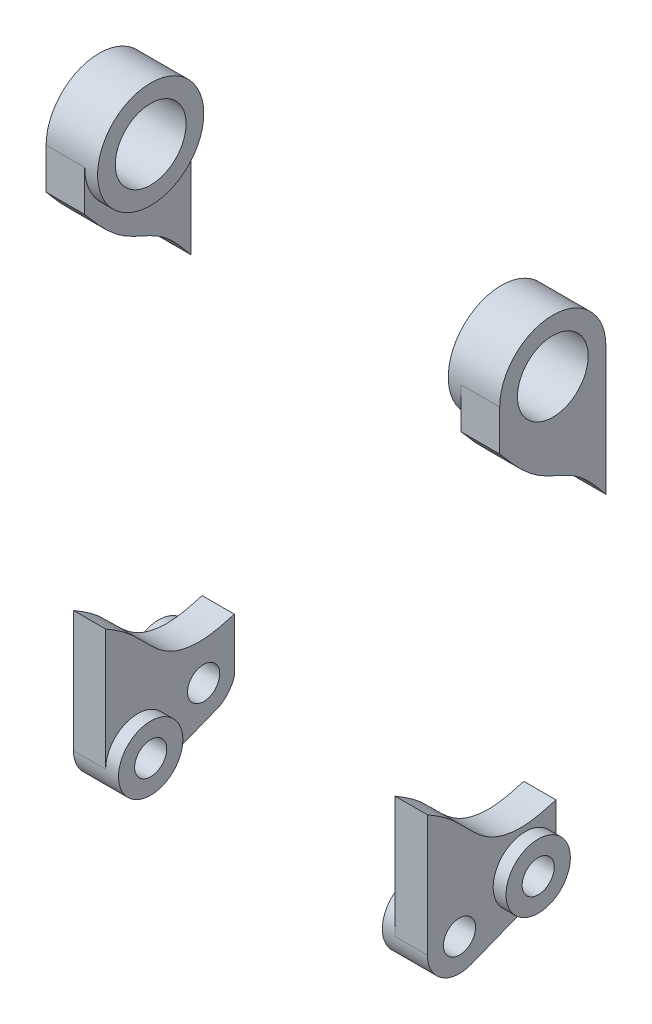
ISO-10303-21;
HEADER;
FILE_DESCRIPTION(('STEP AP214'),'2;1');
FILE_NAME('part.step','',(''),(''),'','','');
FILE_SCHEMA(('AUTOMOTIVE_DESIGN { 1 0 10303 214 1 1 1 1 }'));
ENDSEC;
DATA;
#1=APPLICATION_CONTEXT('core data for automotive mechanical design processes');
#2=APPLICATION_PROTOCOL_DEFINITION('international standard','automotive_design',2000,#1);
#3=PRODUCT_CONTEXT('',#1,'mechanical');
#4=PRODUCT('Part','Part','',(#3));
#5=PRODUCT_RELATED_PRODUCT_CATEGORY('part','',(#4));
#6=PRODUCT_DEFINITION_FORMATION('','',#4);
#7=PRODUCT_DEFINITION_CONTEXT('part definition',#1,'design');
#8=PRODUCT_DEFINITION('design','',#6,#7);
#9=PRODUCT_DEFINITION_SHAPE('','',#8);
#10=(LENGTH_UNIT() NAMED_UNIT(*) SI_UNIT(.MILLI.,.METRE.));
#11=(NAMED_UNIT(*) PLANE_ANGLE_UNIT() SI_UNIT($,.RADIAN.));
#12=(NAMED_UNIT(*) SI_UNIT($,.STERADIAN.) SOLID_ANGLE_UNIT());
#13=UNCERTAINTY_MEASURE_WITH_UNIT(LENGTH_MEASURE(1.E-05),#10,'distance_accuracy_value','');
#14=(GEOMETRIC_REPRESENTATION_CONTEXT(3) GLOBAL_UNCERTAINTY_ASSIGNED_CONTEXT((#13)) GLOBAL_UNIT_ASSIGNED_CONTEXT((#10,
#11,#12)) REPRESENTATION_CONTEXT('',''));
#15=CARTESIAN_POINT('',(0.,0.,0.));
#16=DIRECTION('',(0.,0.,1.));
#17=DIRECTION('',(1.,0.,0.));
#18=AXIS2_PLACEMENT_3D('',#15,#16,#17);
#19=CARTESIAN_POINT('',(54.5,90.,-3.5));
#20=DIRECTION('',(1.,0.,0.));
#21=DIRECTION('',(0.,0.,-1.));
#22=AXIS2_PLACEMENT_3D('',#19,#20,#21);
#23=PLANE('',#22);
#24=CARTESIAN_POINT('',(54.5,90.,-3.5));
#25=DIRECTION('',(1.,0.,0.));
#26=DIRECTION('',(0.,0.,-1.));
#27=AXIS2_PLACEMENT_3D('',#24,#25,#26);
#28=CIRCLE('',#27,11.);
#29=CARTESIAN_POINT('',(54.5,90.,-14.5));
#30=VERTEX_POINT('',#29);
#31=EDGE_CURVE('E112',#30,#30,#28,.T.);
#32=ORIENTED_EDGE('',*,*,#31,.T.);
#33=EDGE_LOOP('',(#32));
#34=FACE_BOUND('',#33,.T.);
#35=CARTESIAN_POINT('',(54.5,90.,-3.5));
#36=DIRECTION('',(1.,0.,0.));
#37=DIRECTION('',(0.,0.,-1.));
#38=AXIS2_PLACEMENT_3D('',#35,#36,#37);
#39=CIRCLE('',#38,16.5);
#40=CARTESIAN_POINT('',(54.5,90.,-20.));
#41=VERTEX_POINT('',#40);
#42=EDGE_CURVE('E111',#41,#41,#39,.T.);
#43=ORIENTED_EDGE('',*,*,#42,.F.);
#44=EDGE_LOOP('',(#43));
#45=FACE_BOUND('',#44,.T.);
#46=ADVANCED_FACE('F41',(#34,#45),#23,.F.);
#47=CARTESIAN_POINT('',(-70.5,90.,-3.5));
#48=DIRECTION('',(1.,0.,0.));
#49=DIRECTION('',(0.,0.,-1.));
#50=AXIS2_PLACEMENT_3D('',#47,#48,#49);
#51=CYLINDRICAL_SURFACE('',#50,11.);
#52=CARTESIAN_POINT('',(70.5,90.,-3.5));
#53=DIRECTION('',(1.,0.,0.));
#54=DIRECTION('',(0.,0.,-1.));
#55=AXIS2_PLACEMENT_3D('',#52,#53,#54);
#56=CIRCLE('',#55,11.);
#57=CARTESIAN_POINT('',(70.5,90.,-14.5));
#58=VERTEX_POINT('',#57);
#59=EDGE_CURVE('E117',#58,#58,#56,.T.);
#60=ORIENTED_EDGE('',*,*,#59,.T.);
#61=EDGE_LOOP('',(#60));
#62=FACE_BOUND('',#61,.T.);
#63=ORIENTED_EDGE('',*,*,#31,.F.);
#64=EDGE_LOOP('',(#63));
#65=FACE_BOUND('',#64,.T.);
#66=ADVANCED_FACE('F136',(#62,#65),#51,.F.);
#67=CARTESIAN_POINT('',(54.5,90.,-3.5));
#68=DIRECTION('',(1.,0.,0.));
#69=DIRECTION('',(0.,0.,-1.));
#70=AXIS2_PLACEMENT_3D('',#67,#68,#69);
#71=CYLINDRICAL_SURFACE('',#70,16.5);
#72=ORIENTED_EDGE('',*,*,#42,.T.);
#73=EDGE_LOOP('',(#72));
#74=FACE_BOUND('',#73,.T.);
#75=DIRECTION('',(-1.,0.,0.));
#76=VECTOR('',#75,1.);
#77=CARTESIAN_POINT('',(58.5,90.,-20.));
#78=LINE('',#77,#76);
#79=CARTESIAN_POINT('',(70.5,90.,-20.));
#80=VERTEX_POINT('',#79);
#81=CARTESIAN_POINT('',(58.5,90.,-20.));
#82=VERTEX_POINT('',#81);
#83=EDGE_CURVE('E97',#80,#82,#78,.T.);
#84=ORIENTED_EDGE('',*,*,#83,.T.);
#85=CARTESIAN_POINT('',(58.5,90.,-3.5));
#86=DIRECTION('',(1.,0.,0.));
#87=DIRECTION('',(0.,1.,0.));
#88=AXIS2_PLACEMENT_3D('',#85,#86,#87);
#89=CIRCLE('',#88,16.5);
#90=CARTESIAN_POINT('',(58.5,90.,13.));
#91=VERTEX_POINT('',#90);
#92=EDGE_CURVE('E63',#91,#82,#89,.T.);
#93=ORIENTED_EDGE('',*,*,#92,.F.);
#94=DIRECTION('',(1.,0.,0.));
#95=VECTOR('',#94,1.);
#96=CARTESIAN_POINT('',(0.,90.,13.));
#97=LINE('',#96,#95);
#98=CARTESIAN_POINT('',(70.5,90.,13.));
#99=VERTEX_POINT('',#98);
#100=EDGE_CURVE('E99',#91,#99,#97,.T.);
#101=ORIENTED_EDGE('',*,*,#100,.T.);
#102=CARTESIAN_POINT('',(70.5,90.,-3.5));
#103=DIRECTION('',(1.,0.,0.));
#104=DIRECTION('',(0.,0.,-1.));
#105=AXIS2_PLACEMENT_3D('',#102,#103,#104);
#106=CIRCLE('',#105,16.5);
#107=EDGE_CURVE('E109',#80,#99,#106,.T.);
#108=ORIENTED_EDGE('',*,*,#107,.F.);
#109=EDGE_LOOP('',(#84,#93,#101,#108));
#110=FACE_BOUND('',#109,.T.);
#111=ADVANCED_FACE('F108',(#74,#110),#71,.T.);
#112=CARTESIAN_POINT('',(0.,90.,13.));
#113=DIRECTION('',(0.,0.,-1.));
#114=DIRECTION('',(0.,1.,0.));
#115=AXIS2_PLACEMENT_3D('',#112,#113,#114);
#116=PLANE('',#115);
#117=DIRECTION('',(0.,1.,0.));
#118=VECTOR('',#117,1.);
#119=CARTESIAN_POINT('',(58.5,28.5000000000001,13.));
#120=LINE('',#119,#118);
#121=CARTESIAN_POINT('',(58.5,77.3406937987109,13.));
#122=VERTEX_POINT('',#121);
#123=EDGE_CURVE('E12',#122,#91,#120,.T.);
#124=ORIENTED_EDGE('',*,*,#123,.F.);
#125=DIRECTION('',(-1.,0.,0.));
#126=VECTOR('',#125,1.);
#127=CARTESIAN_POINT('',(70.5,77.3406937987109,13.));
#128=LINE('',#127,#126);
#129=CARTESIAN_POINT('',(70.5,77.3406937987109,13.));
#130=VERTEX_POINT('',#129);
#131=EDGE_CURVE('E86',#130,#122,#128,.T.);
#132=ORIENTED_EDGE('',*,*,#131,.F.);
#133=DIRECTION('',(0.,1.,0.));
#134=VECTOR('',#133,1.);
#135=CARTESIAN_POINT('',(70.5,90.,13.));
#136=LINE('',#135,#134);
#137=EDGE_CURVE('E93',#130,#99,#136,.T.);
#138=ORIENTED_EDGE('',*,*,#137,.T.);
#139=ORIENTED_EDGE('',*,*,#100,.F.);
#140=EDGE_LOOP('',(#124,#132,#138,#139));
#141=FACE_BOUND('',#140,.T.);
#142=ADVANCED_FACE('F122',(#141),#116,.F.);
#143=CARTESIAN_POINT('',(48.5,28.5000000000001,-20.));
#144=DIRECTION('',(0.,0.,1.));
#145=DIRECTION('',(1.,0.,0.));
#146=AXIS2_PLACEMENT_3D('',#143,#144,#145);
#147=PLANE('',#146);
#148=DIRECTION('',(0.,1.,0.));
#149=VECTOR('',#148,1.);
#150=CARTESIAN_POINT('',(70.5,90.,-20.));
#151=LINE('',#150,#149);
#152=CARTESIAN_POINT('',(70.5,50.,-20.));
#153=VERTEX_POINT('',#152);
#154=EDGE_CURVE('E91',#153,#80,#151,.T.);
#155=ORIENTED_EDGE('',*,*,#154,.F.);
#156=DIRECTION('',(-1.,0.,0.));
#157=VECTOR('',#156,1.);
#158=CARTESIAN_POINT('',(70.5,50.,-20.));
#159=LINE('',#158,#157);
#160=CARTESIAN_POINT('',(58.5,50.,-20.));
#161=VERTEX_POINT('',#160);
#162=EDGE_CURVE('E80',#153,#161,#159,.T.);
#163=ORIENTED_EDGE('',*,*,#162,.T.);
#164=DIRECTION('',(0.,-1.,0.));
#165=VECTOR('',#164,1.);
#166=CARTESIAN_POINT('',(58.5,28.5000000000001,-20.));
#167=LINE('',#166,#165);
#168=EDGE_CURVE('E49',#82,#161,#167,.T.);
#169=ORIENTED_EDGE('',*,*,#168,.F.);
#170=ORIENTED_EDGE('',*,*,#83,.F.);
#171=EDGE_LOOP('',(#155,#163,#169,#170));
#172=FACE_BOUND('',#171,.T.);
#173=ADVANCED_FACE('F95',(#172),#147,.F.);
#174=CARTESIAN_POINT('',(58.5,28.5000000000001,20.));
#175=DIRECTION('',(1.,0.,0.));
#176=DIRECTION('',(0.,1.,0.));
#177=AXIS2_PLACEMENT_3D('',#174,#175,#176);
#178=PLANE('',#177);
#179=ORIENTED_EDGE('',*,*,#168,.T.);
#180=CARTESIAN_POINT('',(58.5,77.3406937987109,13.));
#181=CARTESIAN_POINT('',(58.5,72.6533538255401,9.0711444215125));
#182=CARTESIAN_POINT('',(58.5,65.0423259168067,2.69169901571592));
#183=CARTESIAN_POINT('',(58.5,60.4766139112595,-11.5413087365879));
#184=CARTESIAN_POINT('',(58.5,53.7542925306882,-16.9688296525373));
#185=CARTESIAN_POINT('',(58.5,50.,-20.));
#186=B_SPLINE_CURVE_WITH_KNOTS('',3,(#180,#181,#182,#183,#184,#185),.UNSPECIFIED.,.F.,.F.,(4,1,
1,4),(0.,0.414470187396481,0.672992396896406,1.),.UNSPECIFIED.);
#187=EDGE_CURVE('E83',#161,#122,#186,.F.);
#188=ORIENTED_EDGE('',*,*,#187,.T.);
#189=ORIENTED_EDGE('',*,*,#123,.T.);
#190=ORIENTED_EDGE('',*,*,#92,.T.);
#191=EDGE_LOOP('',(#179,#188,#189,#190));
#192=FACE_BOUND('',#191,.T.);
#193=ADVANCED_FACE('F105',(#192),#178,.F.);
#194=CARTESIAN_POINT('',(70.5,90.,20.));
#195=DIRECTION('',(-1.,0.,0.));
#196=DIRECTION('',(0.,0.,1.));
#197=AXIS2_PLACEMENT_3D('',#194,#195,#196);
#198=PLANE('',#197);
#199=ORIENTED_EDGE('',*,*,#59,.F.);
#200=EDGE_LOOP('',(#199));
#201=FACE_BOUND('',#200,.T.);
#202=ORIENTED_EDGE('',*,*,#137,.F.);
#203=CARTESIAN_POINT('',(70.5,77.3406937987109,13.));
#204=CARTESIAN_POINT('',(70.5,72.6533538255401,9.0711444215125));
#205=CARTESIAN_POINT('',(70.5,65.0423259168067,2.69169901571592));
#206=CARTESIAN_POINT('',(70.5,60.4766139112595,-11.5413087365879));
#207=CARTESIAN_POINT('',(70.5,53.7542925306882,-16.9688296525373));
#208=CARTESIAN_POINT('',(70.5,50.,-20.));
#209=B_SPLINE_CURVE_WITH_KNOTS('',3,(#203,#204,#205,#206,#207,#208),.UNSPECIFIED.,.F.,.F.,(4,1,
1,4),(0.,0.414470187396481,0.672992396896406,1.),.UNSPECIFIED.);
#210=EDGE_CURVE('E56',#130,#153,#209,.T.);
#211=ORIENTED_EDGE('',*,*,#210,.T.);
#212=ORIENTED_EDGE('',*,*,#154,.T.);
#213=ORIENTED_EDGE('',*,*,#107,.T.);
#214=EDGE_LOOP('',(#202,#211,#212,#213));
#215=FACE_BOUND('',#214,.T.);
#216=ADVANCED_FACE('F43',(#201,#215),#198,.F.);
#217=DIRECTION('',(-1.,0.,0.));
#218=VECTOR('',#217,1.);
#219=SURFACE_OF_LINEAR_EXTRUSION('',#209,#218);
#220=ORIENTED_EDGE('',*,*,#162,.F.);
#221=ORIENTED_EDGE('',*,*,#210,.F.);
#222=ORIENTED_EDGE('',*,*,#131,.T.);
#223=ORIENTED_EDGE('',*,*,#187,.F.);
#224=EDGE_LOOP('',(#220,#221,#222,#223));
#225=FACE_BOUND('',#224,.T.);
#226=ADVANCED_FACE('F81',(#225),#219,.F.);
#227=CLOSED_SHELL('',(#46,#66,#111,#142,#173,#193,#216,#226));
#228=MANIFOLD_SOLID_BREP('B2',#227);
#229=CARTESIAN_POINT('',(-54.5,90.,-3.5));
#230=DIRECTION('',(-1.,0.,0.));
#231=DIRECTION('',(0.,0.,-1.));
#232=AXIS2_PLACEMENT_3D('',#229,#230,#231);
#233=PLANE('',#232);
#234=CARTESIAN_POINT('',(-54.5,90.,-3.5));
#235=DIRECTION('',(-1.,0.,0.));
#236=DIRECTION('',(0.,0.,1.));
#237=AXIS2_PLACEMENT_3D('',#234,#235,#236);
#238=CIRCLE('',#237,11.);
#239=CARTESIAN_POINT('',(-54.5,90.,7.49999999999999));
#240=VERTEX_POINT('',#239);
#241=EDGE_CURVE('E309',#240,#240,#238,.T.);
#242=ORIENTED_EDGE('',*,*,#241,.T.);
#243=EDGE_LOOP('',(#242));
#244=FACE_BOUND('',#243,.T.);
#245=CARTESIAN_POINT('',(-54.5,90.,-3.5));
#246=DIRECTION('',(1.,0.,0.));
#247=DIRECTION('',(0.,0.,-1.));
#248=AXIS2_PLACEMENT_3D('',#245,#246,#247);
#249=CIRCLE('',#248,16.5);
#250=CARTESIAN_POINT('',(-54.5,90.,-20.));
#251=VERTEX_POINT('',#250);
#252=EDGE_CURVE('E306',#251,#251,#249,.T.);
#253=ORIENTED_EDGE('',*,*,#252,.T.);
#254=EDGE_LOOP('',(#253));
#255=FACE_BOUND('',#254,.T.);
#256=ADVANCED_FACE('F233',(#244,#255),#233,.F.);
#257=CARTESIAN_POINT('',(-70.5,90.,-3.5));
#258=DIRECTION('',(1.,0.,0.));
#259=DIRECTION('',(0.,0.,-1.));
#260=AXIS2_PLACEMENT_3D('',#257,#258,#259);
#261=CYLINDRICAL_SURFACE('',#260,11.);
#262=CARTESIAN_POINT('',(-70.5,90.,-3.5));
#263=DIRECTION('',(1.,0.,0.));
#264=DIRECTION('',(0.,0.,-1.));
#265=AXIS2_PLACEMENT_3D('',#262,#263,#264);
#266=CIRCLE('',#265,11.);
#267=CARTESIAN_POINT('',(-70.5,90.,-14.5));
#268=VERTEX_POINT('',#267);
#269=EDGE_CURVE('E297',#268,#268,#266,.T.);
#270=ORIENTED_EDGE('',*,*,#269,.F.);
#271=EDGE_LOOP('',(#270));
#272=FACE_BOUND('',#271,.T.);
#273=ORIENTED_EDGE('',*,*,#241,.F.);
#274=EDGE_LOOP('',(#273));
#275=FACE_BOUND('',#274,.T.);
#276=ADVANCED_FACE('F335',(#272,#275),#261,.F.);
#277=CARTESIAN_POINT('',(-54.5,90.,-3.5));
#278=DIRECTION('',(-1.,0.,0.));
#279=DIRECTION('',(0.,0.,1.));
#280=AXIS2_PLACEMENT_3D('',#277,#278,#279);
#281=CYLINDRICAL_SURFACE('',#280,16.5);
#282=DIRECTION('',(1.,0.,0.));
#283=VECTOR('',#282,1.);
#284=CARTESIAN_POINT('',(-58.5,90.,-20.));
#285=LINE('',#284,#283);
#286=CARTESIAN_POINT('',(-70.5,90.,-20.));
#287=VERTEX_POINT('',#286);
#288=CARTESIAN_POINT('',(-58.5,90.,-20.));
#289=VERTEX_POINT('',#288);
#290=EDGE_CURVE('E288',#287,#289,#285,.T.);
#291=ORIENTED_EDGE('',*,*,#290,.F.);
#292=CARTESIAN_POINT('',(-70.5,90.,-3.5));
#293=DIRECTION('',(1.,0.,0.));
#294=DIRECTION('',(0.,0.,-1.));
#295=AXIS2_PLACEMENT_3D('',#292,#293,#294);
#296=CIRCLE('',#295,16.5);
#297=CARTESIAN_POINT('',(-70.5,90.,13.));
#298=VERTEX_POINT('',#297);
#299=EDGE_CURVE('E283',#287,#298,#296,.T.);
#300=ORIENTED_EDGE('',*,*,#299,.T.);
#301=DIRECTION('',(-1.,0.,0.));
#302=VECTOR('',#301,1.);
#303=CARTESIAN_POINT('',(70.5,90.,13.));
#304=LINE('',#303,#302);
#305=CARTESIAN_POINT('',(-58.5,90.,13.));
#306=VERTEX_POINT('',#305);
#307=EDGE_CURVE('E275',#306,#298,#304,.T.);
#308=ORIENTED_EDGE('',*,*,#307,.F.);
#309=CARTESIAN_POINT('',(-58.5,90.,-3.5));
#310=DIRECTION('',(1.,0.,0.));
#311=DIRECTION('',(0.,1.,0.));
#312=AXIS2_PLACEMENT_3D('',#309,#310,#311);
#313=CIRCLE('',#312,16.5);
#314=EDGE_CURVE('E280',#289,#306,#313,.F.);
#315=ORIENTED_EDGE('',*,*,#314,.F.);
#316=EDGE_LOOP('',(#291,#300,#308,#315));
#317=FACE_BOUND('',#316,.T.);
#318=ORIENTED_EDGE('',*,*,#252,.F.);
#319=EDGE_LOOP('',(#318));
#320=FACE_BOUND('',#319,.T.);
#321=ADVANCED_FACE('F278',(#317,#320),#281,.T.);
#322=CARTESIAN_POINT('',(48.5,28.5000000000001,-20.));
#323=DIRECTION('',(0.,0.,1.));
#324=DIRECTION('',(1.,0.,0.));
#325=AXIS2_PLACEMENT_3D('',#322,#323,#324);
#326=PLANE('',#325);
#327=DIRECTION('',(0.,-1.,0.));
#328=VECTOR('',#327,1.);
#329=CARTESIAN_POINT('',(-58.5,28.5000000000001,-20.));
#330=LINE('',#329,#328);
#331=CARTESIAN_POINT('',(-58.5,50.,-20.));
#332=VERTEX_POINT('',#331);
#333=EDGE_CURVE('E295',#289,#332,#330,.T.);
#334=ORIENTED_EDGE('',*,*,#333,.T.);
#335=DIRECTION('',(-1.,0.,0.));
#336=VECTOR('',#335,1.);
#337=CARTESIAN_POINT('',(70.5,50.,-20.));
#338=LINE('',#337,#336);
#339=CARTESIAN_POINT('',(-70.5,50.,-20.));
#340=VERTEX_POINT('',#339);
#341=EDGE_CURVE('E252',#332,#340,#338,.T.);
#342=ORIENTED_EDGE('',*,*,#341,.T.);
#343=DIRECTION('',(0.,1.,0.));
#344=VECTOR('',#343,1.);
#345=CARTESIAN_POINT('',(-70.5,90.,-20.));
#346=LINE('',#345,#344);
#347=EDGE_CURVE('E322',#340,#287,#346,.T.);
#348=ORIENTED_EDGE('',*,*,#347,.T.);
#349=ORIENTED_EDGE('',*,*,#290,.T.);
#350=EDGE_LOOP('',(#334,#342,#348,#349));
#351=FACE_BOUND('',#350,.T.);
#352=ADVANCED_FACE('F327',(#351),#326,.F.);
#353=CARTESIAN_POINT('',(70.5,90.,13.));
#354=DIRECTION('',(0.,0.,1.));
#355=DIRECTION('',(0.,-1.,0.));
#356=AXIS2_PLACEMENT_3D('',#353,#354,#355);
#357=PLANE('',#356);
#358=DIRECTION('',(-1.,0.,0.));
#359=VECTOR('',#358,1.);
#360=CARTESIAN_POINT('',(70.5,77.3406937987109,13.));
#361=LINE('',#360,#359);
#362=CARTESIAN_POINT('',(-58.5,77.3406937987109,13.));
#363=VERTEX_POINT('',#362);
#364=CARTESIAN_POINT('',(-70.5,77.3406937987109,13.));
#365=VERTEX_POINT('',#364);
#366=EDGE_CURVE('E245',#363,#365,#361,.T.);
#367=ORIENTED_EDGE('',*,*,#366,.F.);
#368=DIRECTION('',(0.,-1.,0.));
#369=VECTOR('',#368,1.);
#370=CARTESIAN_POINT('',(-58.5,28.5000000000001,13.));
#371=LINE('',#370,#369);
#372=EDGE_CURVE('E293',#306,#363,#371,.T.);
#373=ORIENTED_EDGE('',*,*,#372,.F.);
#374=ORIENTED_EDGE('',*,*,#307,.T.);
#375=DIRECTION('',(0.,1.,0.));
#376=VECTOR('',#375,1.);
#377=CARTESIAN_POINT('',(-70.5,90.,13.));
#378=LINE('',#377,#376);
#379=EDGE_CURVE('E287',#365,#298,#378,.T.);
#380=ORIENTED_EDGE('',*,*,#379,.F.);
#381=EDGE_LOOP('',(#367,#373,#374,#380));
#382=FACE_BOUND('',#381,.T.);
#383=ADVANCED_FACE('F299',(#382),#357,.T.);
#384=CARTESIAN_POINT('',(-70.5,90.,20.));
#385=DIRECTION('',(-1.,0.,0.));
#386=DIRECTION('',(0.,0.,1.));
#387=AXIS2_PLACEMENT_3D('',#384,#385,#386);
#388=PLANE('',#387);
#389=CARTESIAN_POINT('',(-70.5,77.3406937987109,13.));
#390=CARTESIAN_POINT('',(-70.5,72.6533538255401,9.0711444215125));
#391=CARTESIAN_POINT('',(-70.5,65.0423259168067,2.69169901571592));
#392=CARTESIAN_POINT('',(-70.5,60.4766139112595,-11.5413087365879));
#393=CARTESIAN_POINT('',(-70.5,53.7542925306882,-16.9688296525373));
#394=CARTESIAN_POINT('',(-70.5,50.,-20.));
#395=B_SPLINE_CURVE_WITH_KNOTS('',3,(#389,#390,#391,#392,#393,#394),.UNSPECIFIED.,.F.,.F.,(4,1,
1,4),(0.,0.414470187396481,0.672992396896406,1.),.UNSPECIFIED.);
#396=EDGE_CURVE('E39',#365,#340,#395,.T.);
#397=ORIENTED_EDGE('',*,*,#396,.F.);
#398=ORIENTED_EDGE('',*,*,#379,.T.);
#399=ORIENTED_EDGE('',*,*,#299,.F.);
#400=ORIENTED_EDGE('',*,*,#347,.F.);
#401=EDGE_LOOP('',(#397,#398,#399,#400));
#402=FACE_BOUND('',#401,.T.);
#403=ORIENTED_EDGE('',*,*,#269,.T.);
#404=EDGE_LOOP('',(#403));
#405=FACE_BOUND('',#404,.T.);
#406=ADVANCED_FACE('F350',(#402,#405),#388,.T.);
#407=CARTESIAN_POINT('',(-58.5,28.5000000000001,20.));
#408=DIRECTION('',(1.,0.,0.));
#409=DIRECTION('',(0.,1.,0.));
#410=AXIS2_PLACEMENT_3D('',#407,#408,#409);
#411=PLANE('',#410);
#412=CARTESIAN_POINT('',(-58.5,77.3406937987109,13.));
#413=CARTESIAN_POINT('',(-58.5,72.6533538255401,9.0711444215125));
#414=CARTESIAN_POINT('',(-58.5,65.0423259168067,2.69169901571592));
#415=CARTESIAN_POINT('',(-58.5,60.4766139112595,-11.5413087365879));
#416=CARTESIAN_POINT('',(-58.5,53.7542925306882,-16.9688296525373));
#417=CARTESIAN_POINT('',(-58.5,50.,-20.));
#418=B_SPLINE_CURVE_WITH_KNOTS('',3,(#412,#413,#414,#415,#416,#417),.UNSPECIFIED.,.F.,.F.,(4,1,
1,4),(0.,0.414470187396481,0.672992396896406,1.),.UNSPECIFIED.);
#419=EDGE_CURVE('E264',#332,#363,#418,.F.);
#420=ORIENTED_EDGE('',*,*,#419,.F.);
#421=ORIENTED_EDGE('',*,*,#333,.F.);
#422=ORIENTED_EDGE('',*,*,#314,.T.);
#423=ORIENTED_EDGE('',*,*,#372,.T.);
#424=EDGE_LOOP('',(#420,#421,#422,#423));
#425=FACE_BOUND('',#424,.T.);
#426=ADVANCED_FACE('F292',(#425),#411,.T.);
#427=CARTESIAN_POINT('',(70.5,77.3406937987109,13.));
#428=CARTESIAN_POINT('',(70.5,72.6533538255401,9.0711444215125));
#429=CARTESIAN_POINT('',(70.5,65.0423259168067,2.69169901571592));
#430=CARTESIAN_POINT('',(70.5,60.4766139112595,-11.5413087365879));
#431=CARTESIAN_POINT('',(70.5,53.7542925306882,-16.9688296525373));
#432=CARTESIAN_POINT('',(70.5,50.,-20.));
#433=B_SPLINE_CURVE_WITH_KNOTS('',3,(#427,#428,#429,#430,#431,#432),.UNSPECIFIED.,.F.,.F.,(4,1,
1,4),(0.,0.414470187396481,0.672992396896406,1.),.UNSPECIFIED.);
#434=DIRECTION('',(-1.,0.,0.));
#435=VECTOR('',#434,1.);
#436=SURFACE_OF_LINEAR_EXTRUSION('',#433,#435);
#437=ORIENTED_EDGE('',*,*,#419,.T.);
#438=ORIENTED_EDGE('',*,*,#366,.T.);
#439=ORIENTED_EDGE('',*,*,#396,.T.);
#440=ORIENTED_EDGE('',*,*,#341,.F.);
#441=EDGE_LOOP('',(#437,#438,#439,#440));
#442=FACE_BOUND('',#441,.T.);
#443=ADVANCED_FACE('F235',(#442),#436,.F.);
#444=CLOSED_SHELL('',(#256,#276,#321,#352,#383,#406,#426,#443));
#445=MANIFOLD_SOLID_BREP('B6',#444);
#446=CARTESIAN_POINT('',(-59.,-53.7695526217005,-10.4606079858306));
#447=DIRECTION('',(-1.,0.,0.));
#448=DIRECTION('',(0.,0.,-1.));
#449=AXIS2_PLACEMENT_3D('',#446,#447,#448);
#450=PLANE('',#449);
#451=CARTESIAN_POINT('',(-59.,-53.7695526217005,-10.4606079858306));
#452=DIRECTION('',(-1.,0.,0.));
#453=DIRECTION('',(0.,0.,1.));
#454=AXIS2_PLACEMENT_3D('',#451,#452,#453);
#455=CIRCLE('',#454,5.);
#456=CARTESIAN_POINT('',(-59.,-53.7695526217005,-5.46060798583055));
#457=VERTEX_POINT('',#456);
#458=EDGE_CURVE('E546',#457,#457,#455,.T.);
#459=ORIENTED_EDGE('',*,*,#458,.F.);
#460=EDGE_LOOP('',(#459));
#461=FACE_BOUND('',#460,.T.);
#462=CARTESIAN_POINT('',(-59.,-53.7695526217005,-10.4606079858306));
#463=DIRECTION('',(1.,0.,0.));
#464=DIRECTION('',(0.,0.,-1.));
#465=AXIS2_PLACEMENT_3D('',#462,#463,#464);
#466=CIRCLE('',#465,10.);
#467=CARTESIAN_POINT('',(-59.,-53.7695526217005,-20.4606079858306));
#468=VERTEX_POINT('',#467);
#469=EDGE_CURVE('E527',#468,#468,#466,.T.);
#470=ORIENTED_EDGE('',*,*,#469,.F.);
#471=EDGE_LOOP('',(#470));
#472=FACE_BOUND('',#471,.T.);
#473=ADVANCED_FACE('F430',(#461,#472),#450,.T.);
#474=CARTESIAN_POINT('',(-55.,-53.7695526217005,-10.4606079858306));
#475=DIRECTION('',(-1.,0.,0.));
#476=DIRECTION('',(0.,0.,-1.));
#477=AXIS2_PLACEMENT_3D('',#474,#475,#476);
#478=PLANE('',#477);
#479=CARTESIAN_POINT('',(-55.,-53.7695526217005,-10.4606079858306));
#480=DIRECTION('',(1.,0.,0.));
#481=DIRECTION('',(0.,0.,-1.));
#482=AXIS2_PLACEMENT_3D('',#479,#480,#481);
#483=CIRCLE('',#482,10.);
#484=CARTESIAN_POINT('',(-55.,-63.4582889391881,-12.9361662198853));
#485=VERTEX_POINT('',#484);
#486=CARTESIAN_POINT('',(-55.,-62.533267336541,-15.2769659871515));
#487=VERTEX_POINT('',#486);
#488=EDGE_CURVE('E537',#485,#487,#483,.T.);
#489=ORIENTED_EDGE('',*,*,#488,.T.);
#490=DIRECTION('',(0.,-0.367517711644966,0.930016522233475));
#491=VECTOR('',#490,1.);
#492=CARTESIAN_POINT('',(-55.,-71.0697178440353,6.32482288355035));
#493=LINE('',#492,#491);
#494=EDGE_CURVE('E534',#487,#485,#493,.T.);
#495=ORIENTED_EDGE('',*,*,#494,.T.);
#496=EDGE_LOOP('',(#489,#495));
#497=FACE_BOUND('',#496,.T.);
#498=ADVANCED_FACE('F595',(#497),#478,.F.);
#499=CARTESIAN_POINT('',(-41.,-61.7695526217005,9.99999999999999));
#500=DIRECTION('',(1.,0.,0.));
#501=DIRECTION('',(0.,0.,1.));
#502=AXIS2_PLACEMENT_3D('',#499,#500,#501);
#503=PLANE('',#502);
#504=CARTESIAN_POINT('',(-41.,-61.7695526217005,9.99999999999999));
#505=DIRECTION('',(1.,0.,0.));
#506=DIRECTION('',(0.,0.,-1.));
#507=AXIS2_PLACEMENT_3D('',#504,#505,#506);
#508=CIRCLE('',#507,5.);
#509=CARTESIAN_POINT('',(-41.,-61.7695526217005,4.99999999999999));
#510=VERTEX_POINT('',#509);
#511=EDGE_CURVE('E547',#510,#510,#508,.T.);
#512=ORIENTED_EDGE('',*,*,#511,.F.);
#513=EDGE_LOOP('',(#512));
#514=FACE_BOUND('',#513,.T.);
#515=CARTESIAN_POINT('',(-41.,-61.7695526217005,9.99999999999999));
#516=DIRECTION('',(-1.,0.,0.));
#517=DIRECTION('',(0.,0.,1.));
#518=AXIS2_PLACEMENT_3D('',#515,#516,#517);
#519=CIRCLE('',#518,10.);
#520=CARTESIAN_POINT('',(-41.,-61.7695526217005,20.));
#521=VERTEX_POINT('',#520);
#522=EDGE_CURVE('E519',#521,#521,#519,.T.);
#523=ORIENTED_EDGE('',*,*,#522,.F.);
#524=EDGE_LOOP('',(#523));
#525=FACE_BOUND('',#524,.T.);
#526=ADVANCED_FACE('F593',(#514,#525),#503,.T.);
#527=CARTESIAN_POINT('',(-55.,-56.7695526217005,-20.));
#528=VERTEX_POINT('',#527);
#529=CARTESIAN_POINT('',(-55.,-50.7695526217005,-20.));
#530=VERTEX_POINT('',#529);
#531=EDGE_CURVE('E536',#528,#530,#483,.T.);
#532=ORIENTED_EDGE('',*,*,#531,.T.);
#533=DIRECTION('',(0.,1.,0.));
#534=VECTOR('',#533,1.);
#535=CARTESIAN_POINT('',(-55.,-1.76955262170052,-20.));
#536=LINE('',#535,#534);
#537=EDGE_CURVE('E528',#528,#530,#536,.T.);
#538=ORIENTED_EDGE('',*,*,#537,.F.);
#539=EDGE_LOOP('',(#532,#538));
#540=FACE_BOUND('',#539,.T.);
#541=ADVANCED_FACE('F585',(#540),#478,.F.);
#542=CARTESIAN_POINT('',(-145.,-61.7695526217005,9.99999999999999));
#543=DIRECTION('',(1.,0.,0.));
#544=DIRECTION('',(0.,0.,-1.));
#545=AXIS2_PLACEMENT_3D('',#542,#543,#544);
#546=CYLINDRICAL_SURFACE('',#545,5.);
#547=ORIENTED_EDGE('',*,*,#511,.T.);
#548=EDGE_LOOP('',(#547));
#549=FACE_BOUND('',#548,.T.);
#550=CARTESIAN_POINT('',(-55.,-61.7695526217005,9.99999999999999));
#551=DIRECTION('',(1.,0.,0.));
#552=DIRECTION('',(0.,0.,-1.));
#553=AXIS2_PLACEMENT_3D('',#550,#551,#552);
#554=CIRCLE('',#553,5.);
#555=CARTESIAN_POINT('',(-55.,-61.7695526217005,4.99999999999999));
#556=VERTEX_POINT('',#555);
#557=EDGE_CURVE('E507',#556,#556,#554,.T.);
#558=ORIENTED_EDGE('',*,*,#557,.F.);
#559=EDGE_LOOP('',(#558));
#560=FACE_BOUND('',#559,.T.);
#561=ADVANCED_FACE('F602',(#549,#560),#546,.F.);
#562=CARTESIAN_POINT('',(-145.,-53.7695526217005,-10.4606079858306));
#563=DIRECTION('',(1.,0.,0.));
#564=DIRECTION('',(0.,0.,-1.));
#565=AXIS2_PLACEMENT_3D('',#562,#563,#564);
#566=CYLINDRICAL_SURFACE('',#565,5.);
#567=CARTESIAN_POINT('',(-45.,-53.7695526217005,-10.4606079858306));
#568=DIRECTION('',(1.,0.,0.));
#569=DIRECTION('',(0.,0.,-1.));
#570=AXIS2_PLACEMENT_3D('',#567,#568,#569);
#571=CIRCLE('',#570,5.);
#572=CARTESIAN_POINT('',(-45.,-53.7695526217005,-15.4606079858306));
#573=VERTEX_POINT('',#572);
#574=EDGE_CURVE('E544',#573,#573,#571,.T.);
#575=ORIENTED_EDGE('',*,*,#574,.T.);
#576=EDGE_LOOP('',(#575));
#577=FACE_BOUND('',#576,.T.);
#578=ORIENTED_EDGE('',*,*,#458,.T.);
#579=EDGE_LOOP('',(#578));
#580=FACE_BOUND('',#579,.T.);
#581=ADVANCED_FACE('F615',(#577,#580),#566,.F.);
#582=CARTESIAN_POINT('',(-45.,-53.7695526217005,-10.4606079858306));
#583=DIRECTION('',(-1.,0.,0.));
#584=DIRECTION('',(0.,0.,1.));
#585=AXIS2_PLACEMENT_3D('',#582,#583,#584);
#586=CYLINDRICAL_SURFACE('',#585,10.);
#587=DIRECTION('',(-1.,0.,0.));
#588=VECTOR('',#587,1.);
#589=CARTESIAN_POINT('',(-45.,-62.533267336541,-15.2769659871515));
#590=LINE('',#589,#588);
#591=CARTESIAN_POINT('',(-45.,-62.533267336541,-15.2769659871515));
#592=VERTEX_POINT('',#591);
#593=EDGE_CURVE('E540',#592,#487,#590,.T.);
#594=ORIENTED_EDGE('',*,*,#593,.T.);
#595=ORIENTED_EDGE('',*,*,#488,.F.);
#596=EDGE_CURVE('E541',#530,#485,#483,.T.);
#597=ORIENTED_EDGE('',*,*,#596,.F.);
#598=ORIENTED_EDGE('',*,*,#531,.F.);
#599=DIRECTION('',(-1.,0.,0.));
#600=VECTOR('',#599,1.);
#601=CARTESIAN_POINT('',(-45.,-56.7695526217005,-20.));
#602=LINE('',#601,#600);
#603=CARTESIAN_POINT('',(-45.,-56.7695526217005,-20.));
#604=VERTEX_POINT('',#603);
#605=EDGE_CURVE('E530',#604,#528,#602,.T.);
#606=ORIENTED_EDGE('',*,*,#605,.F.);
#607=CARTESIAN_POINT('',(-45.,-53.7695526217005,-10.4606079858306));
#608=DIRECTION('',(1.,0.,0.));
#609=DIRECTION('',(0.,0.,1.));
#610=AXIS2_PLACEMENT_3D('',#607,#608,#609);
#611=CIRCLE('',#610,10.);
#612=EDGE_CURVE('E505',#592,#604,#611,.T.);
#613=ORIENTED_EDGE('',*,*,#612,.F.);
#614=EDGE_LOOP('',(#594,#595,#597,#598,#606,#613));
#615=FACE_BOUND('',#614,.T.);
#616=ORIENTED_EDGE('',*,*,#469,.T.);
#617=EDGE_LOOP('',(#616));
#618=FACE_BOUND('',#617,.T.);
#619=ADVANCED_FACE('F580',(#615,#618),#586,.T.);
#620=CARTESIAN_POINT('',(-45.,-71.0697178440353,6.32482288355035));
#621=DIRECTION('',(0.,0.930016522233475,0.367517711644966));
#622=DIRECTION('',(0.,-0.367517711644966,0.930016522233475));
#623=AXIS2_PLACEMENT_3D('',#620,#621,#622);
#624=PLANE('',#623);
#625=DIRECTION('',(0.,0.367517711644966,-0.930016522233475));
#626=VECTOR('',#625,1.);
#627=CARTESIAN_POINT('',(-55.,-71.0697178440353,6.32482288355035));
#628=LINE('',#627,#626);
#629=CARTESIAN_POINT('',(-55.,-71.0697178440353,6.32482288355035));
#630=VERTEX_POINT('',#629);
#631=EDGE_CURVE('E524',#630,#485,#628,.T.);
#632=ORIENTED_EDGE('',*,*,#631,.T.);
#633=ORIENTED_EDGE('',*,*,#494,.F.);
#634=ORIENTED_EDGE('',*,*,#593,.F.);
#635=DIRECTION('',(0.,0.367517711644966,-0.930016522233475));
#636=VECTOR('',#635,1.);
#637=CARTESIAN_POINT('',(-45.,-71.0697178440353,6.32482288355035));
#638=LINE('',#637,#636);
#639=CARTESIAN_POINT('',(-45.,-71.0697178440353,6.32482288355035));
#640=VERTEX_POINT('',#639);
#641=EDGE_CURVE('E512',#640,#592,#638,.T.);
#642=ORIENTED_EDGE('',*,*,#641,.F.);
#643=DIRECTION('',(-1.,0.,0.));
#644=VECTOR('',#643,1.);
#645=CARTESIAN_POINT('',(-45.,-71.0697178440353,6.32482288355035));
#646=LINE('',#645,#644);
#647=EDGE_CURVE('E523',#640,#630,#646,.T.);
#648=ORIENTED_EDGE('',*,*,#647,.T.);
#649=EDGE_LOOP('',(#632,#633,#634,#642,#648));
#650=FACE_BOUND('',#649,.T.);
#651=ADVANCED_FACE('F577',(#650),#624,.F.);
#652=CARTESIAN_POINT('',(-45.,-61.7695526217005,9.99999999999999));
#653=DIRECTION('',(-1.,0.,0.));
#654=DIRECTION('',(0.,0.,1.));
#655=AXIS2_PLACEMENT_3D('',#652,#653,#654);
#656=CYLINDRICAL_SURFACE('',#655,10.);
#657=CARTESIAN_POINT('',(-55.,-61.7695526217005,9.99999999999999));
#658=DIRECTION('',(1.,0.,0.));
#659=DIRECTION('',(0.,0.,1.));
#660=AXIS2_PLACEMENT_3D('',#657,#658,#659);
#661=CIRCLE('',#660,10.);
#662=CARTESIAN_POINT('',(-55.,-61.7695526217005,20.));
#663=VERTEX_POINT('',#662);
#664=EDGE_CURVE('E520',#663,#630,#661,.T.);
#665=ORIENTED_EDGE('',*,*,#664,.T.);
#666=ORIENTED_EDGE('',*,*,#647,.F.);
#667=CARTESIAN_POINT('',(-45.,-61.7695526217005,9.99999999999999));
#668=DIRECTION('',(-1.,0.,0.));
#669=DIRECTION('',(0.,0.,1.));
#670=AXIS2_PLACEMENT_3D('',#667,#668,#669);
#671=CIRCLE('',#670,10.);
#672=CARTESIAN_POINT('',(-45.,-61.7695526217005,20.));
#673=VERTEX_POINT('',#672);
#674=EDGE_CURVE('E518',#673,#640,#671,.T.);
#675=ORIENTED_EDGE('',*,*,#674,.F.);
#676=DIRECTION('',(-1.,0.,0.));
#677=VECTOR('',#676,1.);
#678=CARTESIAN_POINT('',(-45.,-61.7695526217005,20.));
#679=LINE('',#678,#677);
#680=EDGE_CURVE('E522',#673,#663,#679,.T.);
#681=ORIENTED_EDGE('',*,*,#680,.T.);
#682=EDGE_LOOP('',(#665,#666,#675,#681));
#683=FACE_BOUND('',#682,.T.);
#684=ORIENTED_EDGE('',*,*,#522,.T.);
#685=EDGE_LOOP('',(#684));
#686=FACE_BOUND('',#685,.T.);
#687=ADVANCED_FACE('F587',(#683,#686),#656,.T.);
#688=CARTESIAN_POINT('',(-45.,-61.7695526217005,9.99999999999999));
#689=DIRECTION('',(1.,0.,0.));
#690=DIRECTION('',(0.,0.,1.));
#691=AXIS2_PLACEMENT_3D('',#688,#689,#690);
#692=PLANE('',#691);
#693=CARTESIAN_POINT('',(-45.,-40.,-20.));
#694=CARTESIAN_POINT('',(-45.,-40.926502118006,-16.7133945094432));
#695=CARTESIAN_POINT('',(-45.,-42.7795063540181,-10.1401835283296));
#696=CARTESIAN_POINT('',(-45.,-40.4464724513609,3.01669955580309));
#697=CARTESIAN_POINT('',(-45.,-29.8862096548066,10.2570562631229));
#698=CARTESIAN_POINT('',(-45.,-25.4565221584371,17.5891423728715));
#699=CARTESIAN_POINT('',(-45.,-24.,20.));
#700=B_SPLINE_CURVE_WITH_KNOTS('',3,(#693,#694,#695,#696,#697,#698,#699),.UNSPECIFIED.,.F.,.F.,
(4,1,1,1,4),(0.,0.221448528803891,0.442897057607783,0.816819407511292,1.),.UNSPECIFIED.);
#701=CARTESIAN_POINT('',(-45.,-24.,20.));
#702=VERTEX_POINT('',#701);
#703=CARTESIAN_POINT('',(-45.,-40.,-20.));
#704=VERTEX_POINT('',#703);
#705=EDGE_CURVE('E442',#702,#704,#700,.F.);
#706=ORIENTED_EDGE('',*,*,#705,.F.);
#707=DIRECTION('',(0.,-1.,0.));
#708=VECTOR('',#707,1.);
#709=CARTESIAN_POINT('',(-45.,-1.7695526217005,20.));
#710=LINE('',#709,#708);
#711=EDGE_CURVE('E516',#702,#673,#710,.T.);
#712=ORIENTED_EDGE('',*,*,#711,.T.);
#713=ORIENTED_EDGE('',*,*,#674,.T.);
#714=ORIENTED_EDGE('',*,*,#641,.T.);
#715=ORIENTED_EDGE('',*,*,#612,.T.);
#716=DIRECTION('',(0.,1.,0.));
#717=VECTOR('',#716,1.);
#718=CARTESIAN_POINT('',(-45.,-1.76955262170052,-20.));
#719=LINE('',#718,#717);
#720=EDGE_CURVE('E498',#604,#704,#719,.T.);
#721=ORIENTED_EDGE('',*,*,#720,.T.);
#722=EDGE_LOOP('',(#706,#712,#713,#714,#715,#721));
#723=FACE_BOUND('',#722,.T.);
#724=ORIENTED_EDGE('',*,*,#574,.F.);
#725=EDGE_LOOP('',(#724));
#726=FACE_BOUND('',#725,.T.);
#727=ADVANCED_FACE('F502',(#723,#726),#692,.T.);
#728=CARTESIAN_POINT('',(-55.,-1.76955262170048,10.));
#729=DIRECTION('',(1.,0.,0.));
#730=DIRECTION('',(0.,0.,-1.));
#731=AXIS2_PLACEMENT_3D('',#728,#729,#730);
#732=PLANE('',#731);
#733=ORIENTED_EDGE('',*,*,#557,.T.);
#734=EDGE_LOOP('',(#733));
#735=FACE_BOUND('',#734,.T.);
#736=DIRECTION('',(0.,1.,0.));
#737=VECTOR('',#736,1.);
#738=CARTESIAN_POINT('',(-55.,-1.76955262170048,20.));
#739=LINE('',#738,#737);
#740=CARTESIAN_POINT('',(-55.,-24.,20.));
#741=VERTEX_POINT('',#740);
#742=EDGE_CURVE('E510',#663,#741,#739,.T.);
#743=ORIENTED_EDGE('',*,*,#742,.T.);
#744=CARTESIAN_POINT('',(-55.,-40.,-20.));
#745=CARTESIAN_POINT('',(-55.,-40.926502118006,-16.7133945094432));
#746=CARTESIAN_POINT('',(-55.,-42.7795063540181,-10.1401835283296));
#747=CARTESIAN_POINT('',(-55.,-40.4464724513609,3.01669955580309));
#748=CARTESIAN_POINT('',(-55.,-29.8862096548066,10.2570562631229));
#749=CARTESIAN_POINT('',(-55.,-25.4565221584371,17.5891423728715));
#750=CARTESIAN_POINT('',(-55.,-24.,20.));
#751=B_SPLINE_CURVE_WITH_KNOTS('',3,(#744,#745,#746,#747,#748,#749,#750),.UNSPECIFIED.,.F.,.F.,
(4,1,1,1,4),(0.,0.221448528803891,0.442897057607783,0.816819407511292,1.),.UNSPECIFIED.);
#752=CARTESIAN_POINT('',(-55.,-40.,-20.));
#753=VERTEX_POINT('',#752);
#754=EDGE_CURVE('E450',#741,#753,#751,.F.);
#755=ORIENTED_EDGE('',*,*,#754,.T.);
#756=EDGE_CURVE('E501',#530,#753,#536,.T.);
#757=ORIENTED_EDGE('',*,*,#756,.F.);
#758=ORIENTED_EDGE('',*,*,#596,.T.);
#759=ORIENTED_EDGE('',*,*,#631,.F.);
#760=ORIENTED_EDGE('',*,*,#664,.F.);
#761=EDGE_LOOP('',(#743,#755,#757,#758,#759,#760));
#762=FACE_BOUND('',#761,.T.);
#763=ADVANCED_FACE('F559',(#735,#762),#732,.F.);
#764=CARTESIAN_POINT('',(48.5,28.5000000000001,-20.));
#765=DIRECTION('',(0.,0.,1.));
#766=DIRECTION('',(1.,0.,0.));
#767=AXIS2_PLACEMENT_3D('',#764,#765,#766);
#768=PLANE('',#767);
#769=ORIENTED_EDGE('',*,*,#756,.T.);
#770=DIRECTION('',(-1.,0.,0.));
#771=VECTOR('',#770,1.);
#772=CARTESIAN_POINT('',(70.5,-40.,-20.));
#773=LINE('',#772,#771);
#774=EDGE_CURVE('E231',#704,#753,#773,.T.);
#775=ORIENTED_EDGE('',*,*,#774,.F.);
#776=ORIENTED_EDGE('',*,*,#720,.F.);
#777=ORIENTED_EDGE('',*,*,#605,.T.);
#778=ORIENTED_EDGE('',*,*,#537,.T.);
#779=EDGE_LOOP('',(#769,#775,#776,#777,#778));
#780=FACE_BOUND('',#779,.T.);
#781=ADVANCED_FACE('F496',(#780),#768,.F.);
#782=CARTESIAN_POINT('',(48.5,28.5000000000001,20.));
#783=DIRECTION('',(0.,0.,1.));
#784=DIRECTION('',(1.,0.,0.));
#785=AXIS2_PLACEMENT_3D('',#782,#783,#784);
#786=PLANE('',#785);
#787=DIRECTION('',(-1.,0.,0.));
#788=VECTOR('',#787,1.);
#789=CARTESIAN_POINT('',(70.5,-24.,20.));
#790=LINE('',#789,#788);
#791=EDGE_CURVE('E485',#702,#741,#790,.T.);
#792=ORIENTED_EDGE('',*,*,#791,.T.);
#793=ORIENTED_EDGE('',*,*,#742,.F.);
#794=ORIENTED_EDGE('',*,*,#680,.F.);
#795=ORIENTED_EDGE('',*,*,#711,.F.);
#796=EDGE_LOOP('',(#792,#793,#794,#795));
#797=FACE_BOUND('',#796,.T.);
#798=ADVANCED_FACE('F432',(#797),#786,.T.);
#799=CARTESIAN_POINT('',(70.5,-40.,-20.));
#800=CARTESIAN_POINT('',(70.5,-40.926502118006,-16.7133945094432));
#801=CARTESIAN_POINT('',(70.5,-42.7795063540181,-10.1401835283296));
#802=CARTESIAN_POINT('',(70.5,-40.4464724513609,3.01669955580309));
#803=CARTESIAN_POINT('',(70.5,-29.8862096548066,10.2570562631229));
#804=CARTESIAN_POINT('',(70.5,-25.4565221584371,17.5891423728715));
#805=CARTESIAN_POINT('',(70.5,-24.,20.));
#806=B_SPLINE_CURVE_WITH_KNOTS('',3,(#799,#800,#801,#802,#803,#804,#805),.UNSPECIFIED.,.F.,.F.,
(4,1,1,1,4),(0.,0.221448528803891,0.442897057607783,0.816819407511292,1.),.UNSPECIFIED.);
#807=DIRECTION('',(-1.,0.,0.));
#808=VECTOR('',#807,1.);
#809=SURFACE_OF_LINEAR_EXTRUSION('',#806,#808);
#810=ORIENTED_EDGE('',*,*,#791,.F.);
#811=ORIENTED_EDGE('',*,*,#705,.T.);
#812=ORIENTED_EDGE('',*,*,#774,.T.);
#813=ORIENTED_EDGE('',*,*,#754,.F.);
#814=EDGE_LOOP('',(#810,#811,#812,#813));
#815=FACE_BOUND('',#814,.T.);
#816=ADVANCED_FACE('F488',(#815),#809,.F.);
#817=CLOSED_SHELL('',(#473,#498,#526,#541,#561,#581,#619,#651,#687,#727,#763,#781,#798,#816));
#818=MANIFOLD_SOLID_BREP('B33',#817);
#819=CARTESIAN_POINT('',(48.5,28.5000000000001,-20.));
#820=DIRECTION('',(0.,0.,1.));
#821=DIRECTION('',(1.,0.,0.));
#822=AXIS2_PLACEMENT_3D('',#819,#820,#821);
#823=PLANE('',#822);
#824=DIRECTION('',(0.,1.,0.));
#825=VECTOR('',#824,1.);
#826=CARTESIAN_POINT('',(45.,-1.76955262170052,-20.));
#827=LINE('',#826,#825);
#828=CARTESIAN_POINT('',(45.,-56.7695526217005,-20.));
#829=VERTEX_POINT('',#828);
#830=CARTESIAN_POINT('',(45.,-40.,-20.));
#831=VERTEX_POINT('',#830);
#832=EDGE_CURVE('E832',#829,#831,#827,.T.);
#833=ORIENTED_EDGE('',*,*,#832,.T.);
#834=DIRECTION('',(-1.,0.,0.));
#835=VECTOR('',#834,1.);
#836=CARTESIAN_POINT('',(70.5,-40.,-20.));
#837=LINE('',#836,#835);
#838=CARTESIAN_POINT('',(55.,-40.,-20.));
#839=VERTEX_POINT('',#838);
#840=EDGE_CURVE('E775',#839,#831,#837,.T.);
#841=ORIENTED_EDGE('',*,*,#840,.F.);
#842=DIRECTION('',(0.,1.,0.));
#843=VECTOR('',#842,1.);
#844=CARTESIAN_POINT('',(55.,-1.76955262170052,-20.));
#845=LINE('',#844,#843);
#846=CARTESIAN_POINT('',(55.,-50.7695526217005,-20.));
#847=VERTEX_POINT('',#846);
#848=EDGE_CURVE('E856',#847,#839,#845,.T.);
#849=ORIENTED_EDGE('',*,*,#848,.F.);
#850=CARTESIAN_POINT('',(55.,-56.7695526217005,-20.));
#851=VERTEX_POINT('',#850);
#852=EDGE_CURVE('E851',#851,#847,#845,.T.);
#853=ORIENTED_EDGE('',*,*,#852,.F.);
#854=DIRECTION('',(1.,0.,0.));
#855=VECTOR('',#854,1.);
#856=CARTESIAN_POINT('',(45.,-56.7695526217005,-20.));
#857=LINE('',#856,#855);
#858=EDGE_CURVE('E837',#829,#851,#857,.T.);
#859=ORIENTED_EDGE('',*,*,#858,.F.);
#860=EDGE_LOOP('',(#833,#841,#849,#853,#859));
#861=FACE_BOUND('',#860,.T.);
#862=ADVANCED_FACE('F763',(#861),#823,.F.);
#863=CARTESIAN_POINT('',(48.5,28.5000000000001,20.));
#864=DIRECTION('',(0.,0.,1.));
#865=DIRECTION('',(1.,0.,0.));
#866=AXIS2_PLACEMENT_3D('',#863,#864,#865);
#867=PLANE('',#866);
#868=DIRECTION('',(-1.,0.,0.));
#869=VECTOR('',#868,1.);
#870=CARTESIAN_POINT('',(70.5,-24.,20.));
#871=LINE('',#870,#869);
#872=CARTESIAN_POINT('',(55.,-24.,20.));
#873=VERTEX_POINT('',#872);
#874=CARTESIAN_POINT('',(45.,-24.,20.));
#875=VERTEX_POINT('',#874);
#876=EDGE_CURVE('E782',#873,#875,#871,.T.);
#877=ORIENTED_EDGE('',*,*,#876,.T.);
#878=DIRECTION('',(0.,-1.,0.));
#879=VECTOR('',#878,1.);
#880=CARTESIAN_POINT('',(45.,-1.7695526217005,20.));
#881=LINE('',#880,#879);
#882=CARTESIAN_POINT('',(45.,-61.7695526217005,20.));
#883=VERTEX_POINT('',#882);
#884=EDGE_CURVE('E835',#875,#883,#881,.T.);
#885=ORIENTED_EDGE('',*,*,#884,.T.);
#886=DIRECTION('',(1.,0.,0.));
#887=VECTOR('',#886,1.);
#888=CARTESIAN_POINT('',(45.,-61.7695526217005,20.));
#889=LINE('',#888,#887);
#890=CARTESIAN_POINT('',(55.,-61.7695526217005,20.));
#891=VERTEX_POINT('',#890);
#892=EDGE_CURVE('E850',#883,#891,#889,.T.);
#893=ORIENTED_EDGE('',*,*,#892,.T.);
#894=DIRECTION('',(0.,1.,0.));
#895=VECTOR('',#894,1.);
#896=CARTESIAN_POINT('',(55.,-1.76955262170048,20.));
#897=LINE('',#896,#895);
#898=EDGE_CURVE('E864',#891,#873,#897,.T.);
#899=ORIENTED_EDGE('',*,*,#898,.T.);
#900=EDGE_LOOP('',(#877,#885,#893,#899));
#901=FACE_BOUND('',#900,.T.);
#902=ADVANCED_FACE('F923',(#901),#867,.T.);
#903=CARTESIAN_POINT('',(55.,-1.76955262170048,10.));
#904=DIRECTION('',(1.,0.,0.));
#905=DIRECTION('',(0.,0.,-1.));
#906=AXIS2_PLACEMENT_3D('',#903,#904,#905);
#907=PLANE('',#906);
#908=CARTESIAN_POINT('',(55.,-40.,-20.));
#909=CARTESIAN_POINT('',(55.,-40.926502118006,-16.7133945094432));
#910=CARTESIAN_POINT('',(55.,-42.7795063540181,-10.1401835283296));
#911=CARTESIAN_POINT('',(55.,-40.4464724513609,3.01669955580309));
#912=CARTESIAN_POINT('',(55.,-29.8862096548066,10.2570562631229));
#913=CARTESIAN_POINT('',(55.,-25.4565221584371,17.5891423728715));
#914=CARTESIAN_POINT('',(55.,-24.,20.));
#915=B_SPLINE_CURVE_WITH_KNOTS('',3,(#908,#909,#910,#911,#912,#913,#914),.UNSPECIFIED.,.F.,.F.,
(4,1,1,1,4),(0.,0.221448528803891,0.442897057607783,0.816819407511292,1.),.UNSPECIFIED.);
#916=EDGE_CURVE('E818',#873,#839,#915,.F.);
#917=ORIENTED_EDGE('',*,*,#916,.F.);
#918=ORIENTED_EDGE('',*,*,#898,.F.);
#919=CARTESIAN_POINT('',(55.,-61.7695526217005,9.99999999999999));
#920=DIRECTION('',(1.,0.,0.));
#921=DIRECTION('',(0.,0.,1.));
#922=AXIS2_PLACEMENT_3D('',#919,#920,#921);
#923=CIRCLE('',#922,10.);
#924=CARTESIAN_POINT('',(55.,-71.0697178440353,6.32482288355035));
#925=VERTEX_POINT('',#924);
#926=EDGE_CURVE('E860',#891,#925,#923,.T.);
#927=ORIENTED_EDGE('',*,*,#926,.T.);
#928=DIRECTION('',(0.,0.367517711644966,-0.930016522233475));
#929=VECTOR('',#928,1.);
#930=CARTESIAN_POINT('',(55.,-71.0697178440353,6.32482288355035));
#931=LINE('',#930,#929);
#932=CARTESIAN_POINT('',(55.,-63.4582889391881,-12.9361662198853));
#933=VERTEX_POINT('',#932);
#934=EDGE_CURVE('E857',#925,#933,#931,.T.);
#935=ORIENTED_EDGE('',*,*,#934,.T.);
#936=CARTESIAN_POINT('',(55.,-53.7695526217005,-10.4606079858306));
#937=DIRECTION('',(1.,0.,0.));
#938=DIRECTION('',(0.,0.,-1.));
#939=AXIS2_PLACEMENT_3D('',#936,#937,#938);
#940=CIRCLE('',#939,10.);
#941=EDGE_CURVE('E872',#847,#933,#940,.T.);
#942=ORIENTED_EDGE('',*,*,#941,.F.);
#943=ORIENTED_EDGE('',*,*,#848,.T.);
#944=EDGE_LOOP('',(#917,#918,#927,#935,#942,#943));
#945=FACE_BOUND('',#944,.T.);
#946=CARTESIAN_POINT('',(55.,-61.7695526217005,9.99999999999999));
#947=DIRECTION('',(1.,0.,0.));
#948=DIRECTION('',(0.,0.,-1.));
#949=AXIS2_PLACEMENT_3D('',#946,#947,#948);
#950=CIRCLE('',#949,5.);
#951=CARTESIAN_POINT('',(55.,-61.7695526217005,4.99999999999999));
#952=VERTEX_POINT('',#951);
#953=EDGE_CURVE('E882',#952,#952,#950,.T.);
#954=ORIENTED_EDGE('',*,*,#953,.F.);
#955=EDGE_LOOP('',(#954));
#956=FACE_BOUND('',#955,.T.);
#957=ADVANCED_FACE('F928',(#945,#956),#907,.T.);
#958=CARTESIAN_POINT('',(45.,-61.7695526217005,9.99999999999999));
#959=DIRECTION('',(-1.,0.,0.));
#960=DIRECTION('',(0.,0.,1.));
#961=AXIS2_PLACEMENT_3D('',#958,#959,#960);
#962=PLANE('',#961);
#963=CARTESIAN_POINT('',(45.,-40.,-20.));
#964=CARTESIAN_POINT('',(45.,-40.926502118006,-16.7133945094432));
#965=CARTESIAN_POINT('',(45.,-42.7795063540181,-10.1401835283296));
#966=CARTESIAN_POINT('',(45.,-40.4464724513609,3.01669955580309));
#967=CARTESIAN_POINT('',(45.,-29.8862096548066,10.2570562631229));
#968=CARTESIAN_POINT('',(45.,-25.4565221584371,17.5891423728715));
#969=CARTESIAN_POINT('',(45.,-24.,20.));
#970=B_SPLINE_CURVE_WITH_KNOTS('',3,(#963,#964,#965,#966,#967,#968,#969),.UNSPECIFIED.,.F.,.F.,
(4,1,1,1,4),(0.,0.221448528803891,0.442897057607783,0.816819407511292,1.),.UNSPECIFIED.);
#971=EDGE_CURVE('E428',#831,#875,#970,.T.);
#972=ORIENTED_EDGE('',*,*,#971,.F.);
#973=ORIENTED_EDGE('',*,*,#832,.F.);
#974=CARTESIAN_POINT('',(45.,-53.7695526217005,-10.4606079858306));
#975=DIRECTION('',(1.,0.,0.));
#976=DIRECTION('',(0.,0.,1.));
#977=AXIS2_PLACEMENT_3D('',#974,#975,#976);
#978=CIRCLE('',#977,10.);
#979=CARTESIAN_POINT('',(45.,-62.533267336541,-15.2769659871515));
#980=VERTEX_POINT('',#979);
#981=EDGE_CURVE('E842',#980,#829,#978,.T.);
#982=ORIENTED_EDGE('',*,*,#981,.F.);
#983=DIRECTION('',(0.,0.367517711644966,-0.930016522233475));
#984=VECTOR('',#983,1.);
#985=CARTESIAN_POINT('',(45.,-71.0697178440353,6.32482288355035));
#986=LINE('',#985,#984);
#987=CARTESIAN_POINT('',(45.,-71.0697178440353,6.32482288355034));
#988=VERTEX_POINT('',#987);
#989=EDGE_CURVE('E844',#988,#980,#986,.T.);
#990=ORIENTED_EDGE('',*,*,#989,.F.);
#991=CARTESIAN_POINT('',(45.,-61.7695526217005,9.99999999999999));
#992=DIRECTION('',(-1.,0.,0.));
#993=DIRECTION('',(0.,0.,1.));
#994=AXIS2_PLACEMENT_3D('',#991,#992,#993);
#995=CIRCLE('',#994,10.);
#996=EDGE_CURVE('E868',#883,#988,#995,.T.);
#997=ORIENTED_EDGE('',*,*,#996,.F.);
#998=ORIENTED_EDGE('',*,*,#884,.F.);
#999=EDGE_LOOP('',(#972,#973,#982,#990,#997,#998));
#1000=FACE_BOUND('',#999,.T.);
#1001=CARTESIAN_POINT('',(45.,-53.7695526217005,-10.4606079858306));
#1002=DIRECTION('',(-1.,0.,0.));
#1003=DIRECTION('',(0.,0.,1.));
#1004=AXIS2_PLACEMENT_3D('',#1001,#1002,#1003);
#1005=CIRCLE('',#1004,5.);
#1006=CARTESIAN_POINT('',(45.,-53.7695526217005,-5.46060798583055));
#1007=VERTEX_POINT('',#1006);
#1008=EDGE_CURVE('E876',#1007,#1007,#1005,.T.);
#1009=ORIENTED_EDGE('',*,*,#1008,.F.);
#1010=EDGE_LOOP('',(#1009));
#1011=FACE_BOUND('',#1010,.T.);
#1012=ADVANCED_FACE('F829',(#1000,#1011),#962,.T.);
#1013=CARTESIAN_POINT('',(45.,-53.7695526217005,-10.4606079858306));
#1014=DIRECTION('',(1.,0.,0.));
#1015=DIRECTION('',(0.,0.,-1.));
#1016=AXIS2_PLACEMENT_3D('',#1013,#1014,#1015);
#1017=CYLINDRICAL_SURFACE('',#1016,10.);
#1018=ORIENTED_EDGE('',*,*,#858,.T.);
#1019=EDGE_CURVE('E875',#851,#847,#940,.T.);
#1020=ORIENTED_EDGE('',*,*,#1019,.T.);
#1021=ORIENTED_EDGE('',*,*,#941,.T.);
#1022=CARTESIAN_POINT('',(55.,-62.533267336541,-15.2769659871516));
#1023=VERTEX_POINT('',#1022);
#1024=EDGE_CURVE('E845',#933,#1023,#940,.T.);
#1025=ORIENTED_EDGE('',*,*,#1024,.T.);
#1026=DIRECTION('',(1.,0.,0.));
#1027=VECTOR('',#1026,1.);
#1028=CARTESIAN_POINT('',(45.,-62.533267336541,-15.2769659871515));
#1029=LINE('',#1028,#1027);
#1030=EDGE_CURVE('E848',#980,#1023,#1029,.T.);
#1031=ORIENTED_EDGE('',*,*,#1030,.F.);
#1032=ORIENTED_EDGE('',*,*,#981,.T.);
#1033=EDGE_LOOP('',(#1018,#1020,#1021,#1025,#1031,#1032));
#1034=FACE_BOUND('',#1033,.T.);
#1035=CARTESIAN_POINT('',(59.,-53.7695526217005,-10.4606079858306));
#1036=DIRECTION('',(1.,0.,0.));
#1037=DIRECTION('',(0.,0.,-1.));
#1038=AXIS2_PLACEMENT_3D('',#1035,#1036,#1037);
#1039=CIRCLE('',#1038,10.);
#1040=CARTESIAN_POINT('',(59.,-53.7695526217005,-20.4606079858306));
#1041=VERTEX_POINT('',#1040);
#1042=EDGE_CURVE('E854',#1041,#1041,#1039,.T.);
#1043=ORIENTED_EDGE('',*,*,#1042,.F.);
#1044=EDGE_LOOP('',(#1043));
#1045=FACE_BOUND('',#1044,.T.);
#1046=ADVANCED_FACE('F917',(#1034,#1045),#1017,.T.);
#1047=CARTESIAN_POINT('',(45.,-71.0697178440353,6.32482288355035));
#1048=DIRECTION('',(0.,-0.930016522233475,-0.367517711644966));
#1049=DIRECTION('',(0.,0.367517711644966,-0.930016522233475));
#1050=AXIS2_PLACEMENT_3D('',#1047,#1048,#1049);
#1051=PLANE('',#1050);
#1052=ORIENTED_EDGE('',*,*,#934,.F.);
#1053=DIRECTION('',(1.,0.,0.));
#1054=VECTOR('',#1053,1.);
#1055=CARTESIAN_POINT('',(45.,-71.0697178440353,6.32482288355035));
#1056=LINE('',#1055,#1054);
#1057=EDGE_CURVE('E867',#988,#925,#1056,.T.);
#1058=ORIENTED_EDGE('',*,*,#1057,.F.);
#1059=ORIENTED_EDGE('',*,*,#989,.T.);
#1060=ORIENTED_EDGE('',*,*,#1030,.T.);
#1061=EDGE_CURVE('E861',#933,#1023,#931,.T.);
#1062=ORIENTED_EDGE('',*,*,#1061,.F.);
#1063=EDGE_LOOP('',(#1052,#1058,#1059,#1060,#1062));
#1064=FACE_BOUND('',#1063,.T.);
#1065=ADVANCED_FACE('F911',(#1064),#1051,.T.);
#1066=CARTESIAN_POINT('',(45.,-61.7695526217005,9.99999999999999));
#1067=DIRECTION('',(1.,0.,0.));
#1068=DIRECTION('',(0.,0.,-1.));
#1069=AXIS2_PLACEMENT_3D('',#1066,#1067,#1068);
#1070=CYLINDRICAL_SURFACE('',#1069,10.);
#1071=ORIENTED_EDGE('',*,*,#926,.F.);
#1072=ORIENTED_EDGE('',*,*,#892,.F.);
#1073=ORIENTED_EDGE('',*,*,#996,.T.);
#1074=ORIENTED_EDGE('',*,*,#1057,.T.);
#1075=EDGE_LOOP('',(#1071,#1072,#1073,#1074));
#1076=FACE_BOUND('',#1075,.T.);
#1077=CARTESIAN_POINT('',(41.,-61.7695526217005,9.99999999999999));
#1078=DIRECTION('',(-1.,0.,0.));
#1079=DIRECTION('',(0.,0.,1.));
#1080=AXIS2_PLACEMENT_3D('',#1077,#1078,#1079);
#1081=CIRCLE('',#1080,10.);
#1082=CARTESIAN_POINT('',(41.,-61.7695526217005,20.));
#1083=VERTEX_POINT('',#1082);
#1084=EDGE_CURVE('E855',#1083,#1083,#1081,.T.);
#1085=ORIENTED_EDGE('',*,*,#1084,.F.);
#1086=EDGE_LOOP('',(#1085));
#1087=FACE_BOUND('',#1086,.T.);
#1088=ADVANCED_FACE('F906',(#1076,#1087),#1070,.T.);
#1089=CARTESIAN_POINT('',(41.,-61.7695526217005,9.99999999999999));
#1090=DIRECTION('',(-1.,0.,0.));
#1091=DIRECTION('',(0.,0.,1.));
#1092=AXIS2_PLACEMENT_3D('',#1089,#1090,#1091);
#1093=PLANE('',#1092);
#1094=CARTESIAN_POINT('',(41.,-61.7695526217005,9.99999999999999));
#1095=DIRECTION('',(-1.,0.,0.));
#1096=DIRECTION('',(0.,0.,1.));
#1097=AXIS2_PLACEMENT_3D('',#1094,#1095,#1096);
#1098=CIRCLE('',#1097,5.);
#1099=CARTESIAN_POINT('',(41.,-61.7695526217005,15.));
#1100=VERTEX_POINT('',#1099);
#1101=EDGE_CURVE('E885',#1100,#1100,#1098,.T.);
#1102=ORIENTED_EDGE('',*,*,#1101,.F.);
#1103=EDGE_LOOP('',(#1102));
#1104=FACE_BOUND('',#1103,.T.);
#1105=ORIENTED_EDGE('',*,*,#1084,.T.);
#1106=EDGE_LOOP('',(#1105));
#1107=FACE_BOUND('',#1106,.T.);
#1108=ADVANCED_FACE('F902',(#1104,#1107),#1093,.T.);
#1109=CARTESIAN_POINT('',(55.,-53.7695526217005,-10.4606079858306));
#1110=DIRECTION('',(1.,0.,0.));
#1111=DIRECTION('',(0.,0.,-1.));
#1112=AXIS2_PLACEMENT_3D('',#1109,#1110,#1111);
#1113=PLANE('',#1112);
#1114=ORIENTED_EDGE('',*,*,#1019,.F.);
#1115=ORIENTED_EDGE('',*,*,#852,.T.);
#1116=EDGE_LOOP('',(#1114,#1115));
#1117=FACE_BOUND('',#1116,.T.);
#1118=ADVANCED_FACE('F905',(#1117),#1113,.F.);
#1119=CARTESIAN_POINT('',(59.,-53.7695526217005,-10.4606079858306));
#1120=DIRECTION('',(1.,0.,0.));
#1121=DIRECTION('',(0.,0.,-1.));
#1122=AXIS2_PLACEMENT_3D('',#1119,#1120,#1121);
#1123=PLANE('',#1122);
#1124=CARTESIAN_POINT('',(59.,-53.7695526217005,-10.4606079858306));
#1125=DIRECTION('',(1.,0.,0.));
#1126=DIRECTION('',(0.,0.,-1.));
#1127=AXIS2_PLACEMENT_3D('',#1124,#1125,#1126);
#1128=CIRCLE('',#1127,5.);
#1129=CARTESIAN_POINT('',(59.,-53.7695526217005,-15.4606079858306));
#1130=VERTEX_POINT('',#1129);
#1131=EDGE_CURVE('E879',#1130,#1130,#1128,.T.);
#1132=ORIENTED_EDGE('',*,*,#1131,.F.);
#1133=EDGE_LOOP('',(#1132));
#1134=FACE_BOUND('',#1133,.T.);
#1135=ORIENTED_EDGE('',*,*,#1042,.T.);
#1136=EDGE_LOOP('',(#1135));
#1137=FACE_BOUND('',#1136,.T.);
#1138=ADVANCED_FACE('F941',(#1134,#1137),#1123,.T.);
#1139=ORIENTED_EDGE('',*,*,#1061,.T.);
#1140=ORIENTED_EDGE('',*,*,#1024,.F.);
#1141=EDGE_LOOP('',(#1139,#1140));
#1142=FACE_BOUND('',#1141,.T.);
#1143=ADVANCED_FACE('F934',(#1142),#1113,.F.);
#1144=CARTESIAN_POINT('',(-145.,-53.7695526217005,-10.4606079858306));
#1145=DIRECTION('',(1.,0.,0.));
#1146=DIRECTION('',(0.,0.,-1.));
#1147=AXIS2_PLACEMENT_3D('',#1144,#1145,#1146);
#1148=CYLINDRICAL_SURFACE('',#1147,5.);
#1149=ORIENTED_EDGE('',*,*,#1008,.T.);
#1150=EDGE_LOOP('',(#1149));
#1151=FACE_BOUND('',#1150,.T.);
#1152=ORIENTED_EDGE('',*,*,#1131,.T.);
#1153=EDGE_LOOP('',(#1152));
#1154=FACE_BOUND('',#1153,.T.);
#1155=ADVANCED_FACE('F931',(#1151,#1154),#1148,.F.);
#1156=CARTESIAN_POINT('',(-145.,-61.7695526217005,9.99999999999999));
#1157=DIRECTION('',(1.,0.,0.));
#1158=DIRECTION('',(0.,0.,-1.));
#1159=AXIS2_PLACEMENT_3D('',#1156,#1157,#1158);
#1160=CYLINDRICAL_SURFACE('',#1159,5.);
#1161=ORIENTED_EDGE('',*,*,#953,.T.);
#1162=EDGE_LOOP('',(#1161));
#1163=FACE_BOUND('',#1162,.T.);
#1164=ORIENTED_EDGE('',*,*,#1101,.T.);
#1165=EDGE_LOOP('',(#1164));
#1166=FACE_BOUND('',#1165,.T.);
#1167=ADVANCED_FACE('F900',(#1163,#1166),#1160,.F.);
#1168=CARTESIAN_POINT('',(70.5,-40.,-20.));
#1169=CARTESIAN_POINT('',(70.5,-40.926502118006,-16.7133945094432));
#1170=CARTESIAN_POINT('',(70.5,-42.7795063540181,-10.1401835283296));
#1171=CARTESIAN_POINT('',(70.5,-40.4464724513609,3.01669955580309));
#1172=CARTESIAN_POINT('',(70.5,-29.8862096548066,10.2570562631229));
#1173=CARTESIAN_POINT('',(70.5,-25.4565221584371,17.5891423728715));
#1174=CARTESIAN_POINT('',(70.5,-24.,20.));
#1175=B_SPLINE_CURVE_WITH_KNOTS('',3,(#1168,#1169,#1170,#1171,#1172,#1173,#1174),.UNSPECIFIED.,
.F.,.F.,(4,1,1,1,4),(0.,0.221448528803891,0.442897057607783,0.816819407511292,1.),.UNSPECIFIED.);
#1176=DIRECTION('',(-1.,0.,0.));
#1177=VECTOR('',#1176,1.);
#1178=SURFACE_OF_LINEAR_EXTRUSION('',#1175,#1177);
#1179=ORIENTED_EDGE('',*,*,#916,.T.);
#1180=ORIENTED_EDGE('',*,*,#840,.T.);
#1181=ORIENTED_EDGE('',*,*,#971,.T.);
#1182=ORIENTED_EDGE('',*,*,#876,.F.);
#1183=EDGE_LOOP('',(#1179,#1180,#1181,#1182));
#1184=FACE_BOUND('',#1183,.T.);
#1185=ADVANCED_FACE('F765',(#1184),#1178,.F.);
#1186=CLOSED_SHELL('',(#862,#902,#957,#1012,#1046,#1065,#1088,#1108,#1118,#1138,#1143,#1155,
#1167,#1185));
#1187=MANIFOLD_SOLID_BREP('B225',#1186);
#1188=ADVANCED_BREP_SHAPE_REPRESENTATION('',(#18,#228,#445,#818,#1187),#14);
#1189=SHAPE_DEFINITION_REPRESENTATION(#9,#1188);
ENDSEC;
END-ISO-10303-21;
